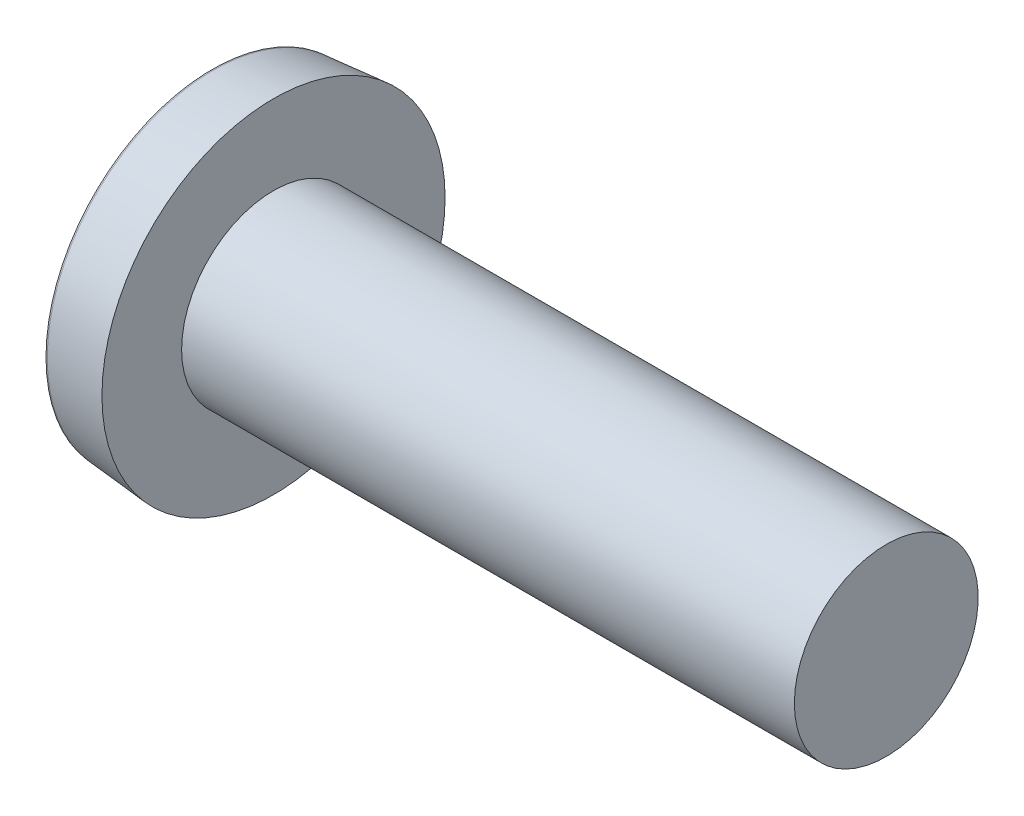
from build123d import *

# Parameters (mm, degrees)
FILLET2_R      = 0.9
SKETCH2_W      = 5.6
SKETCH2_H      = 0.8
SLOT_DEPTH     = 0.7
SKETCH3_W      = 1.730280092
SKETCH3_H      = 7.17745816
EXTRUDE1_DEPTH = 5


with BuildPart() as part:
    # BodySke → Base-Revolve (revolve)
    with BuildSketch(Plane.XY, mode=Mode.PRIVATE) as base_revolve_sk:
        Polygon((1.8, 1.5), (1.8, 2.8), (0, 2.642520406), (0, 0), (11.8, 0), (11.8, 1.5), align=None)
    revolve(base_revolve_sk.sketch.rotate(Axis((-25.4, 0, 0), (1, 0, 0)), 90), axis=Axis((-25.4, 0, 0), (1, 0, 0)))

    # Fillet2
    fillet2_edges = [part.edges().sort_by_distance(p)[0] for p in [
        (0, 0, -2.642520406),
    ]]
    fillet(fillet2_edges, radius=FILLET2_R)

    # Sketch2 → Slot (cut)
    with BuildSketch(Plane(origin=(0, 0, 0), x_dir=(0, 0, -1), z_dir=(1, 0, 0))):
        Rectangle(SKETCH2_W, SKETCH2_H)
    extrude(amount=SLOT_DEPTH, mode=Mode.SUBTRACT)

    # Sketch3 → Extrude1 (cut, symmetric)
    with BuildSketch(Plane(origin=(0, 0, 0), x_dir=(1, 0, 0), z_dir=(0, 1, 0))):
        with Locations((-0.066052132, 0.034049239)):
            Rectangle(SKETCH3_W, SKETCH3_H)
    extrude(amount=EXTRUDE1_DEPTH, both=True, mode=Mode.SUBTRACT)


solid = part.part
